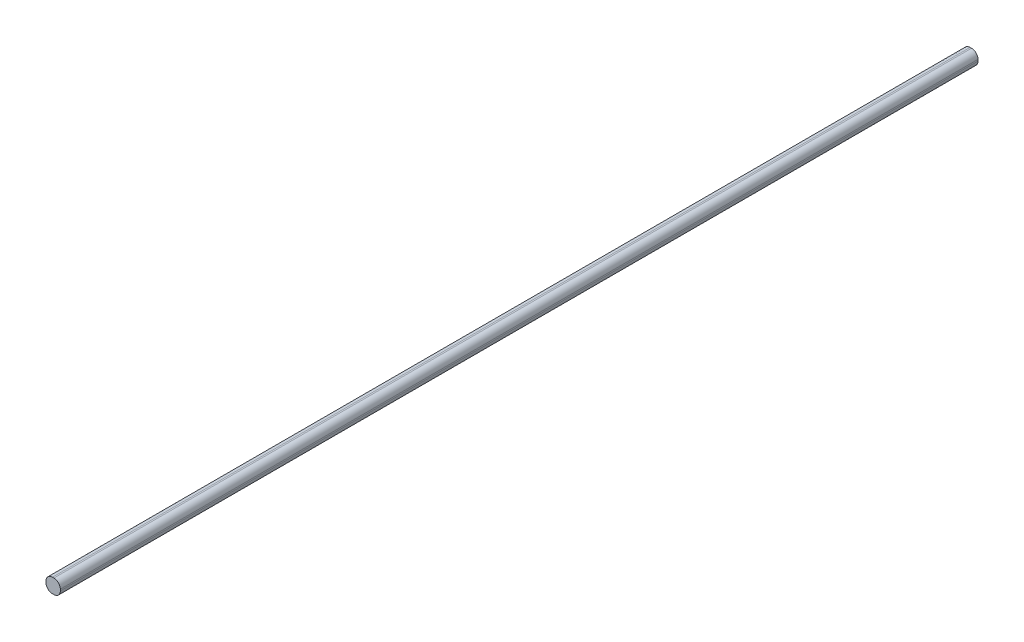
ISO-10303-21;
HEADER;
FILE_DESCRIPTION(('STEP AP214'),'2;1');
FILE_NAME('part.step','',(''),(''),'','','');
FILE_SCHEMA(('AUTOMOTIVE_DESIGN { 1 0 10303 214 1 1 1 1 }'));
ENDSEC;
DATA;
#1=APPLICATION_CONTEXT('core data for automotive mechanical design processes');
#2=APPLICATION_PROTOCOL_DEFINITION('international standard','automotive_design',2000,#1);
#3=PRODUCT_CONTEXT('',#1,'mechanical');
#4=PRODUCT('Part','Part','',(#3));
#5=PRODUCT_RELATED_PRODUCT_CATEGORY('part','',(#4));
#6=PRODUCT_DEFINITION_FORMATION('','',#4);
#7=PRODUCT_DEFINITION_CONTEXT('part definition',#1,'design');
#8=PRODUCT_DEFINITION('design','',#6,#7);
#9=PRODUCT_DEFINITION_SHAPE('','',#8);
#10=(LENGTH_UNIT() NAMED_UNIT(*) SI_UNIT(.MILLI.,.METRE.));
#11=(NAMED_UNIT(*) PLANE_ANGLE_UNIT() SI_UNIT($,.RADIAN.));
#12=(NAMED_UNIT(*) SI_UNIT($,.STERADIAN.) SOLID_ANGLE_UNIT());
#13=UNCERTAINTY_MEASURE_WITH_UNIT(LENGTH_MEASURE(1.E-05),#10,'distance_accuracy_value','');
#14=(GEOMETRIC_REPRESENTATION_CONTEXT(3) GLOBAL_UNCERTAINTY_ASSIGNED_CONTEXT((#13)) GLOBAL_UNIT_ASSIGNED_CONTEXT((#10,
#11,#12)) REPRESENTATION_CONTEXT('',''));
#15=CARTESIAN_POINT('',(0.,0.,0.));
#16=DIRECTION('',(0.,0.,1.));
#17=DIRECTION('',(1.,0.,0.));
#18=AXIS2_PLACEMENT_3D('',#15,#16,#17);
#19=CARTESIAN_POINT('',(3.96875,3.96875,254.));
#20=DIRECTION('',(-1.,0.,0.));
#21=DIRECTION('',(0.,0.,1.));
#22=AXIS2_PLACEMENT_3D('',#19,#20,#21);
#23=PLANE('',#22);
#24=DIRECTION('',(0.,1.,0.));
#25=VECTOR('',#24,1.);
#26=CARTESIAN_POINT('',(3.96875,3.96875,-254.));
#27=LINE('',#26,#25);
#28=CARTESIAN_POINT('',(3.96875,-0.41275,-254.));
#29=VERTEX_POINT('',#28);
#30=CARTESIAN_POINT('',(3.96875,0.41275,-254.));
#31=VERTEX_POINT('',#30);
#32=EDGE_CURVE('E121',#29,#31,#27,.T.);
#33=ORIENTED_EDGE('',*,*,#32,.T.);
#34=DIRECTION('',(0.,0.,-1.));
#35=VECTOR('',#34,1.);
#36=CARTESIAN_POINT('',(3.96875,0.41275,254.));
#37=LINE('',#36,#35);
#38=CARTESIAN_POINT('',(3.96875,0.41275,254.));
#39=VERTEX_POINT('',#38);
#40=EDGE_CURVE('E99',#31,#39,#37,.F.);
#41=ORIENTED_EDGE('',*,*,#40,.T.);
#42=DIRECTION('',(0.,1.,0.));
#43=VECTOR('',#42,1.);
#44=CARTESIAN_POINT('',(3.96875,3.96875,254.));
#45=LINE('',#44,#43);
#46=CARTESIAN_POINT('',(3.96875,-0.41275,254.));
#47=VERTEX_POINT('',#46);
#48=EDGE_CURVE('E129',#47,#39,#45,.T.);
#49=ORIENTED_EDGE('',*,*,#48,.F.);
#50=DIRECTION('',(0.,0.,-1.));
#51=VECTOR('',#50,1.);
#52=CARTESIAN_POINT('',(3.96875,-0.41275,254.));
#53=LINE('',#52,#51);
#54=EDGE_CURVE('E104',#47,#29,#53,.T.);
#55=ORIENTED_EDGE('',*,*,#54,.T.);
#56=EDGE_LOOP('',(#33,#41,#49,#55));
#57=FACE_BOUND('',#56,.T.);
#58=ADVANCED_FACE('F30',(#57),#23,.F.);
#59=CARTESIAN_POINT('',(3.96875,3.96875,254.));
#60=DIRECTION('',(0.,-1.,0.));
#61=DIRECTION('',(0.,0.,-1.));
#62=AXIS2_PLACEMENT_3D('',#59,#60,#61);
#63=PLANE('',#62);
#64=DIRECTION('',(-1.,0.,0.));
#65=VECTOR('',#64,1.);
#66=CARTESIAN_POINT('',(3.96875,3.96875,254.));
#67=LINE('',#66,#65);
#68=CARTESIAN_POINT('',(0.41275,3.96875,254.));
#69=VERTEX_POINT('',#68);
#70=CARTESIAN_POINT('',(-0.412749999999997,3.96875,254.));
#71=VERTEX_POINT('',#70);
#72=EDGE_CURVE('E114',#69,#71,#67,.T.);
#73=ORIENTED_EDGE('',*,*,#72,.F.);
#74=DIRECTION('',(0.,0.,-1.));
#75=VECTOR('',#74,1.);
#76=CARTESIAN_POINT('',(0.41275,3.96875,254.));
#77=LINE('',#76,#75);
#78=CARTESIAN_POINT('',(0.41275,3.96875,-254.));
#79=VERTEX_POINT('',#78);
#80=EDGE_CURVE('E98',#69,#79,#77,.T.);
#81=ORIENTED_EDGE('',*,*,#80,.T.);
#82=DIRECTION('',(-1.,0.,0.));
#83=VECTOR('',#82,1.);
#84=CARTESIAN_POINT('',(3.96875,3.96875,-254.));
#85=LINE('',#84,#83);
#86=CARTESIAN_POINT('',(-0.412749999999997,3.96875,-254.));
#87=VERTEX_POINT('',#86);
#88=EDGE_CURVE('E111',#79,#87,#85,.T.);
#89=ORIENTED_EDGE('',*,*,#88,.T.);
#90=DIRECTION('',(0.,0.,-1.));
#91=VECTOR('',#90,1.);
#92=CARTESIAN_POINT('',(-0.412749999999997,3.96875,254.));
#93=LINE('',#92,#91);
#94=EDGE_CURVE('E116',#87,#71,#93,.F.);
#95=ORIENTED_EDGE('',*,*,#94,.T.);
#96=EDGE_LOOP('',(#73,#81,#89,#95));
#97=FACE_BOUND('',#96,.T.);
#98=ADVANCED_FACE('F110',(#97),#63,.F.);
#99=CARTESIAN_POINT('',(-3.96875,3.96875,254.));
#100=DIRECTION('',(1.,0.,0.));
#101=DIRECTION('',(0.,1.,0.));
#102=AXIS2_PLACEMENT_3D('',#99,#100,#101);
#103=PLANE('',#102);
#104=DIRECTION('',(0.,-1.,0.));
#105=VECTOR('',#104,1.);
#106=CARTESIAN_POINT('',(-3.96875,3.96875,254.));
#107=LINE('',#106,#105);
#108=CARTESIAN_POINT('',(-3.96875,0.412749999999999,254.));
#109=VERTEX_POINT('',#108);
#110=CARTESIAN_POINT('',(-3.96875,-0.412750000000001,254.));
#111=VERTEX_POINT('',#110);
#112=EDGE_CURVE('E133',#109,#111,#107,.T.);
#113=ORIENTED_EDGE('',*,*,#112,.F.);
#114=DIRECTION('',(0.,0.,-1.));
#115=VECTOR('',#114,1.);
#116=CARTESIAN_POINT('',(-3.96875,0.412749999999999,254.));
#117=LINE('',#116,#115);
#118=CARTESIAN_POINT('',(-3.96875,0.412749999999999,-254.));
#119=VERTEX_POINT('',#118);
#120=EDGE_CURVE('E154',#109,#119,#117,.T.);
#121=ORIENTED_EDGE('',*,*,#120,.T.);
#122=DIRECTION('',(0.,-1.,0.));
#123=VECTOR('',#122,1.);
#124=CARTESIAN_POINT('',(-3.96875,3.96875,-254.));
#125=LINE('',#124,#123);
#126=CARTESIAN_POINT('',(-3.96875,-0.412750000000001,-254.));
#127=VERTEX_POINT('',#126);
#128=EDGE_CURVE('E120',#119,#127,#125,.T.);
#129=ORIENTED_EDGE('',*,*,#128,.T.);
#130=DIRECTION('',(0.,0.,-1.));
#131=VECTOR('',#130,1.);
#132=CARTESIAN_POINT('',(-3.96875,-0.412750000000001,254.));
#133=LINE('',#132,#131);
#134=EDGE_CURVE('E152',#127,#111,#133,.F.);
#135=ORIENTED_EDGE('',*,*,#134,.T.);
#136=EDGE_LOOP('',(#113,#121,#129,#135));
#137=FACE_BOUND('',#136,.T.);
#138=ADVANCED_FACE('F174',(#137),#103,.F.);
#139=CARTESIAN_POINT('',(3.96875,-3.96875,254.));
#140=DIRECTION('',(0.,1.,0.));
#141=DIRECTION('',(0.,0.,1.));
#142=AXIS2_PLACEMENT_3D('',#139,#140,#141);
#143=PLANE('',#142);
#144=DIRECTION('',(1.,0.,0.));
#145=VECTOR('',#144,1.);
#146=CARTESIAN_POINT('',(3.96875,-3.96875,-254.));
#147=LINE('',#146,#145);
#148=CARTESIAN_POINT('',(-0.412749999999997,-3.96875,-254.));
#149=VERTEX_POINT('',#148);
#150=CARTESIAN_POINT('',(0.41275,-3.96875,-254.));
#151=VERTEX_POINT('',#150);
#152=EDGE_CURVE('E124',#149,#151,#147,.T.);
#153=ORIENTED_EDGE('',*,*,#152,.T.);
#154=DIRECTION('',(0.,0.,-1.));
#155=VECTOR('',#154,1.);
#156=CARTESIAN_POINT('',(0.41275,-3.96875,254.));
#157=LINE('',#156,#155);
#158=CARTESIAN_POINT('',(0.41275,-3.96875,254.));
#159=VERTEX_POINT('',#158);
#160=EDGE_CURVE('E11',#151,#159,#157,.F.);
#161=ORIENTED_EDGE('',*,*,#160,.T.);
#162=DIRECTION('',(1.,0.,0.));
#163=VECTOR('',#162,1.);
#164=CARTESIAN_POINT('',(3.96875,-3.96875,254.));
#165=LINE('',#164,#163);
#166=CARTESIAN_POINT('',(-0.412749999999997,-3.96875,254.));
#167=VERTEX_POINT('',#166);
#168=EDGE_CURVE('E135',#167,#159,#165,.T.);
#169=ORIENTED_EDGE('',*,*,#168,.F.);
#170=DIRECTION('',(0.,0.,-1.));
#171=VECTOR('',#170,1.);
#172=CARTESIAN_POINT('',(-0.412749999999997,-3.96875,254.));
#173=LINE('',#172,#171);
#174=EDGE_CURVE('E37',#167,#149,#173,.T.);
#175=ORIENTED_EDGE('',*,*,#174,.T.);
#176=EDGE_LOOP('',(#153,#161,#169,#175));
#177=FACE_BOUND('',#176,.T.);
#178=ADVANCED_FACE('F159',(#177),#143,.F.);
#179=CARTESIAN_POINT('',(3.96875,-3.96875,254.));
#180=DIRECTION('',(0.,0.,-1.));
#181=DIRECTION('',(-1.,0.,0.));
#182=AXIS2_PLACEMENT_3D('',#179,#180,#181);
#183=PLANE('',#182);
#184=ORIENTED_EDGE('',*,*,#48,.T.);
#185=CARTESIAN_POINT('',(0.41275,0.41275,254.));
#186=DIRECTION('',(0.,0.,-1.));
#187=DIRECTION('',(-1.,0.,0.));
#188=AXIS2_PLACEMENT_3D('',#185,#186,#187);
#189=CIRCLE('',#188,3.556);
#190=EDGE_CURVE('E150',#39,#69,#189,.F.);
#191=ORIENTED_EDGE('',*,*,#190,.T.);
#192=ORIENTED_EDGE('',*,*,#72,.T.);
#193=CARTESIAN_POINT('',(-0.412749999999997,0.41275,254.));
#194=DIRECTION('',(0.,0.,-1.));
#195=DIRECTION('',(-1.,0.,0.));
#196=AXIS2_PLACEMENT_3D('',#193,#194,#195);
#197=CIRCLE('',#196,3.556);
#198=EDGE_CURVE('E148',#71,#109,#197,.F.);
#199=ORIENTED_EDGE('',*,*,#198,.T.);
#200=ORIENTED_EDGE('',*,*,#112,.T.);
#201=CARTESIAN_POINT('',(-0.412749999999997,-0.41275,254.));
#202=DIRECTION('',(0.,0.,-1.));
#203=DIRECTION('',(-1.,0.,0.));
#204=AXIS2_PLACEMENT_3D('',#201,#202,#203);
#205=CIRCLE('',#204,3.556);
#206=EDGE_CURVE('E49',#111,#167,#205,.F.);
#207=ORIENTED_EDGE('',*,*,#206,.T.);
#208=ORIENTED_EDGE('',*,*,#168,.T.);
#209=CARTESIAN_POINT('',(0.41275,-0.41275,254.));
#210=DIRECTION('',(0.,0.,-1.));
#211=DIRECTION('',(-1.,0.,0.));
#212=AXIS2_PLACEMENT_3D('',#209,#210,#211);
#213=CIRCLE('',#212,3.556);
#214=EDGE_CURVE('E146',#159,#47,#213,.F.);
#215=ORIENTED_EDGE('',*,*,#214,.T.);
#216=EDGE_LOOP('',(#184,#191,#192,#199,#200,#207,#208,#215));
#217=FACE_BOUND('',#216,.T.);
#218=ADVANCED_FACE('F167',(#217),#183,.F.);
#219=CARTESIAN_POINT('',(3.96875,-3.96875,-254.));
#220=DIRECTION('',(0.,0.,-1.));
#221=DIRECTION('',(-1.,0.,0.));
#222=AXIS2_PLACEMENT_3D('',#219,#220,#221);
#223=PLANE('',#222);
#224=ORIENTED_EDGE('',*,*,#88,.F.);
#225=CARTESIAN_POINT('',(0.41275,0.41275,-254.));
#226=DIRECTION('',(0.,0.,-1.));
#227=DIRECTION('',(-1.,0.,0.));
#228=AXIS2_PLACEMENT_3D('',#225,#226,#227);
#229=CIRCLE('',#228,3.556);
#230=EDGE_CURVE('E94',#79,#31,#229,.T.);
#231=ORIENTED_EDGE('',*,*,#230,.T.);
#232=ORIENTED_EDGE('',*,*,#32,.F.);
#233=CARTESIAN_POINT('',(0.41275,-0.41275,-254.));
#234=DIRECTION('',(0.,0.,-1.));
#235=DIRECTION('',(-1.,0.,0.));
#236=AXIS2_PLACEMENT_3D('',#233,#234,#235);
#237=CIRCLE('',#236,3.556);
#238=EDGE_CURVE('E139',#29,#151,#237,.T.);
#239=ORIENTED_EDGE('',*,*,#238,.T.);
#240=ORIENTED_EDGE('',*,*,#152,.F.);
#241=CARTESIAN_POINT('',(-0.412749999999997,-0.41275,-254.));
#242=DIRECTION('',(0.,0.,-1.));
#243=DIRECTION('',(-1.,0.,0.));
#244=AXIS2_PLACEMENT_3D('',#241,#242,#243);
#245=CIRCLE('',#244,3.556);
#246=EDGE_CURVE('E115',#149,#127,#245,.T.);
#247=ORIENTED_EDGE('',*,*,#246,.T.);
#248=ORIENTED_EDGE('',*,*,#128,.F.);
#249=CARTESIAN_POINT('',(-0.412749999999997,0.41275,-254.));
#250=DIRECTION('',(0.,0.,-1.));
#251=DIRECTION('',(-1.,0.,0.));
#252=AXIS2_PLACEMENT_3D('',#249,#250,#251);
#253=CIRCLE('',#252,3.556);
#254=EDGE_CURVE('E105',#119,#87,#253,.T.);
#255=ORIENTED_EDGE('',*,*,#254,.T.);
#256=EDGE_LOOP('',(#224,#231,#232,#239,#240,#247,#248,#255));
#257=FACE_BOUND('',#256,.T.);
#258=ADVANCED_FACE('F118',(#257),#223,.T.);
#259=CARTESIAN_POINT('',(0.41275,0.41275,254.));
#260=DIRECTION('',(0.,0.,-1.));
#261=DIRECTION('',(-1.,0.,0.));
#262=AXIS2_PLACEMENT_3D('',#259,#260,#261);
#263=CYLINDRICAL_SURFACE('',#262,3.556);
#264=ORIENTED_EDGE('',*,*,#190,.F.);
#265=ORIENTED_EDGE('',*,*,#40,.F.);
#266=ORIENTED_EDGE('',*,*,#230,.F.);
#267=ORIENTED_EDGE('',*,*,#80,.F.);
#268=EDGE_LOOP('',(#264,#265,#266,#267));
#269=FACE_BOUND('',#268,.T.);
#270=ADVANCED_FACE('F97',(#269),#263,.T.);
#271=CARTESIAN_POINT('',(-0.412749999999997,0.41275,254.));
#272=DIRECTION('',(0.,0.,-1.));
#273=DIRECTION('',(-1.,0.,0.));
#274=AXIS2_PLACEMENT_3D('',#271,#272,#273);
#275=CYLINDRICAL_SURFACE('',#274,3.556);
#276=ORIENTED_EDGE('',*,*,#198,.F.);
#277=ORIENTED_EDGE('',*,*,#94,.F.);
#278=ORIENTED_EDGE('',*,*,#254,.F.);
#279=ORIENTED_EDGE('',*,*,#120,.F.);
#280=EDGE_LOOP('',(#276,#277,#278,#279));
#281=FACE_BOUND('',#280,.T.);
#282=ADVANCED_FACE('F172',(#281),#275,.T.);
#283=CARTESIAN_POINT('',(0.41275,-0.41275,254.));
#284=DIRECTION('',(0.,0.,-1.));
#285=DIRECTION('',(-1.,0.,0.));
#286=AXIS2_PLACEMENT_3D('',#283,#284,#285);
#287=CYLINDRICAL_SURFACE('',#286,3.556);
#288=ORIENTED_EDGE('',*,*,#214,.F.);
#289=ORIENTED_EDGE('',*,*,#160,.F.);
#290=ORIENTED_EDGE('',*,*,#238,.F.);
#291=ORIENTED_EDGE('',*,*,#54,.F.);
#292=EDGE_LOOP('',(#288,#289,#290,#291));
#293=FACE_BOUND('',#292,.T.);
#294=ADVANCED_FACE('F164',(#293),#287,.T.);
#295=CARTESIAN_POINT('',(-0.412749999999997,-0.41275,254.));
#296=DIRECTION('',(0.,0.,-1.));
#297=DIRECTION('',(-1.,0.,0.));
#298=AXIS2_PLACEMENT_3D('',#295,#296,#297);
#299=CYLINDRICAL_SURFACE('',#298,3.556);
#300=ORIENTED_EDGE('',*,*,#206,.F.);
#301=ORIENTED_EDGE('',*,*,#134,.F.);
#302=ORIENTED_EDGE('',*,*,#246,.F.);
#303=ORIENTED_EDGE('',*,*,#174,.F.);
#304=EDGE_LOOP('',(#300,#301,#302,#303));
#305=FACE_BOUND('',#304,.T.);
#306=ADVANCED_FACE('F176',(#305),#299,.T.);
#307=CLOSED_SHELL('',(#58,#98,#138,#178,#218,#258,#270,#282,#294,#306));
#308=MANIFOLD_SOLID_BREP('B2',#307);
#309=ADVANCED_BREP_SHAPE_REPRESENTATION('',(#18,#308),#14);
#310=SHAPE_DEFINITION_REPRESENTATION(#9,#309);
ENDSEC;
END-ISO-10303-21;
